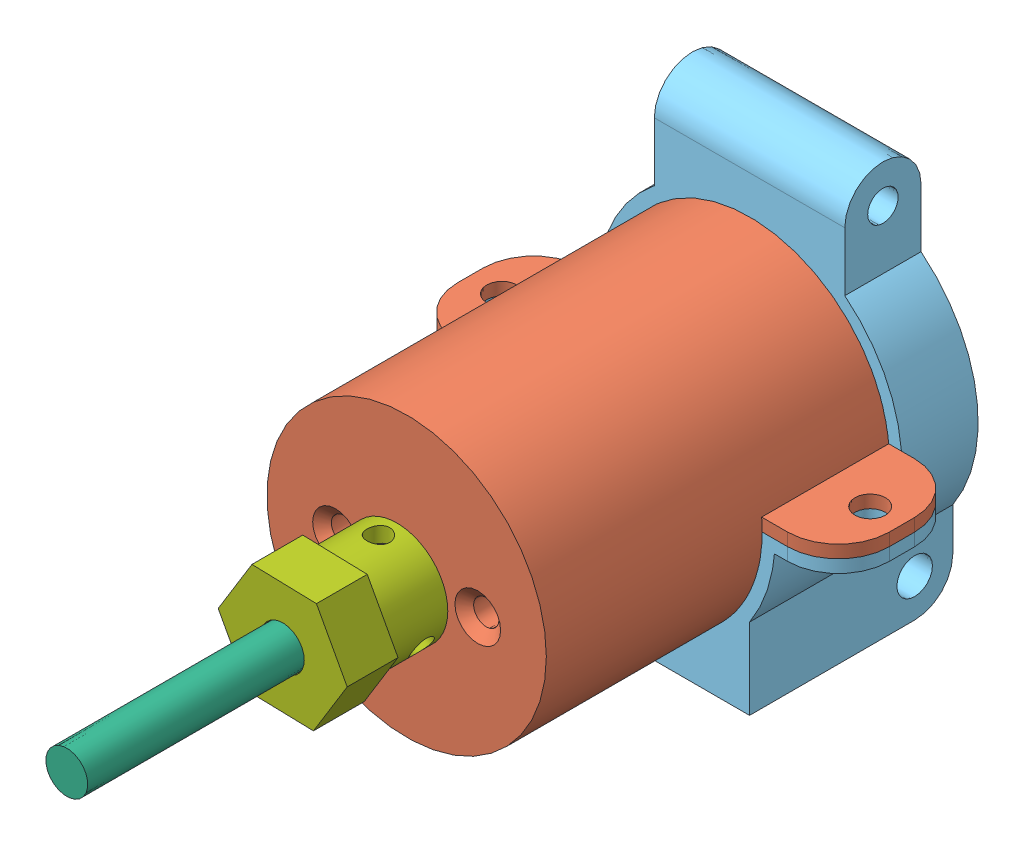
SolidWorks assembly Rear Assembly 2.SLDASM, configuration Default (file format 10000). Lengths in mm.
Overall size (43.18 38.1 75.9).
7 component instances, 7 part files, 13 mates.
Components (placement in the parent):
- Electric Motor 2-1: Electric Motor 2.SLDPRT [Default] at (9.2092 20.1107 39.0041) size (24.13 24.13 33.02)
- Motor Mount 2-1: Motor Mount 2.SLDPRT [Default] at (9.2092 20.1107 39.0041) size (43.18 27.94 41.91)
- Electric Motor 2 Shaft-1: Electric Motor 2 Shaft.SLDPRT [Default] at (9.2092 20.1107 8.5241) x (0.348805 0.937195 0) z (0 0 1) size (2.03 2.03 40.64)
- Rear Axle Part 2.1-1: Rear Axle Part 2.1.SLDPRT [Default] at (9.2092 20.1107 42.5096) x (-0.999965 0.008348 0) z (0 0 1) size (7.11 7.11 7.62)
- Rear Side 2-1: Rear Side 2.SLDPRT [Default] at (9.2092 7.4107 4.7141) x (0 0 -1) z (1 0 0) size (20.32 38.1 43.18)
- 8-32 1-1: 8-32 1.SLDPRT [Default] at (9.2092 20.1107 51.6536) x (-0.923728 -0.383049 0) z (0 0 -1) size (6.86 6.86 29.21)
- Rear Axle Part 1.1-1: Rear Axle Part 1.1.SLDPRT [Default] at (9.2092 20.1107 52.6696) x (0.999965 -0.008348 0) z (0 0 1) size (12.9 11.29 8.89)
Mates (geometry in assembly coordinates):
- Concentric1: concentric anti-aligned: cylinder of Electric Motor 2-1 through (9.2092 20.1107 41.5441) axis (0 0 -1) radius 3.048; cylinder of Motor Mount 2-1 through (9.2092 20.1107 39.0041) axis (0 0 1) radius 3.302
- Concentric2: concentric aligned: cylinder of Motor Mount 2-1 through (16.3212 20.1107 39.0041) axis (0 0 1) radius 1.27; cylinder of Electric Motor 2-1 through (16.3212 20.1107 36.4641) axis (0 0 1) radius 1.143
- Coincident1: coincident anti-aligned: plane of Electric Motor 2-1 through (9.2092 20.1107 39.0041) normal (0 0 1); plane of Motor Mount 2-1 through (9.2092 20.1107 39.0041) normal (0 0 -1)
- Concentric3: concentric anti-aligned: cylinder of Electric Motor 2-1 through (9.2092 20.1107 8.5241) axis (0 0 1) radius 1.016; cylinder of Electric Motor 2 Shaft-1 through (9.2092 20.1107 49.1641) axis (0 0 -1) radius 1.016
- Coincident2: coincident aligned: plane of Electric Motor 2-1 through (9.2092 20.1107 8.5241) normal (0 0 -1); plane of Electric Motor 2 Shaft-1 through (9.2092 20.1107 8.5241) normal (0 0 -1)
- Concentric4: concentric aligned: cylinder of Electric Motor 2 Shaft-1 through (9.2092 20.1107 49.1641) axis (0 0 -1) radius 1.016; cylinder of Rear Axle Part 2.1-1 through (9.2092 20.1107 50.1296) axis (0 0 -1) radius 1.016
- Concentric5: concentric anti-aligned: cylinder of Motor Mount 2-1 through (9.2092 20.1107 0.9041) axis (0 0 1) radius 13.97; cylinder of Rear Side 2-1 through (9.2092 20.1107 8.5241) axis (0 0 -1) radius 13.97
- Coincident3: coincident aligned: plane of Motor Mount 2-1 through (9.2092 20.1107 0.9041) normal (0 0 -1); plane of Rear Side 2-1 through (18.7342 7.4107 0.9041) normal (0 0 -1)
- Parallel1: parallel anti-aligned: plane of Motor Mount 2-1 through (-4.7608 20.1107 -1.5584) normal (0 -1 0); plane of Rear Side 2-1 through (23.1792 20.1107 4.7141) normal (0 1 0)
- Coincident7: coincident anti-aligned: plane of Rear Axle Part 2.1-1 through (9.2092 20.1107 47.5896) normal (0 0 1); plane of 8-32 1-1 through (9.2092 20.1107 47.5896) normal (0 0 -1)
- Concentric11: concentric aligned: cylinder of Rear Axle Part 2.1-1 through (9.2092 20.1107 43.7796) axis (0 0 1) radius 3.556; cylinder of 8-32 1-1 through (9.2092 20.1107 47.5896) axis (0 0 1) radius 3.429
- Concentric12: concentric anti-aligned: cylinder of 8-32 1-1 through (9.2092 20.1107 76.7996) axis (0 0 -1) radius 2.0955; cylinder of Rear Axle Part 1.1-1 through (9.2092 20.1107 52.6696) axis (0 0 1) radius 2.159
- Concentric13: concentric aligned: cylinder of Rear Axle Part 2.1-1 through (9.2389 23.6666 45.6846) axis (-0.008348 -0.999965 0) radius 1.143; cylinder of Rear Axle Part 1.1-1 through (9.2563 25.7576 45.6846) axis (-0.008348 -0.999965 0) radius 1.143
